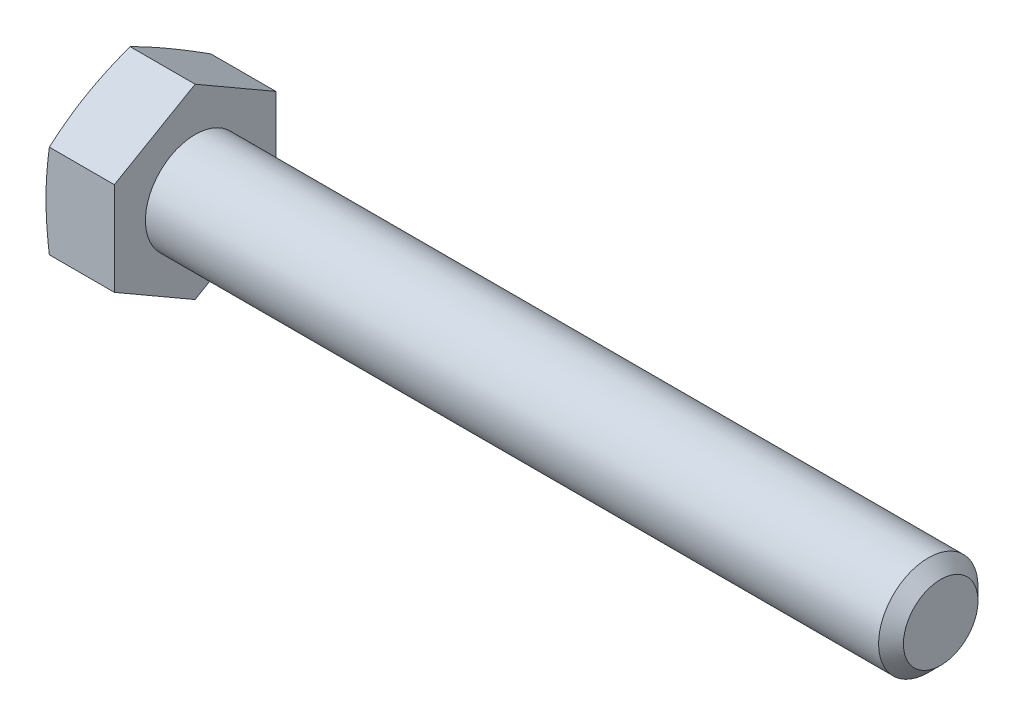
ISO-10303-21;
HEADER;
FILE_DESCRIPTION(('STEP AP214'),'2;1');
FILE_NAME('part.step','',(''),(''),'','','');
FILE_SCHEMA(('AUTOMOTIVE_DESIGN { 1 0 10303 214 1 1 1 1 }'));
ENDSEC;
DATA;
#1=APPLICATION_CONTEXT('core data for automotive mechanical design processes');
#2=APPLICATION_PROTOCOL_DEFINITION('international standard','automotive_design',2000,#1);
#3=PRODUCT_CONTEXT('',#1,'mechanical');
#4=PRODUCT('Part','Part','',(#3));
#5=PRODUCT_RELATED_PRODUCT_CATEGORY('part','',(#4));
#6=PRODUCT_DEFINITION_FORMATION('','',#4);
#7=PRODUCT_DEFINITION_CONTEXT('part definition',#1,'design');
#8=PRODUCT_DEFINITION('design','',#6,#7);
#9=PRODUCT_DEFINITION_SHAPE('','',#8);
#10=(LENGTH_UNIT() NAMED_UNIT(*) SI_UNIT(.MILLI.,.METRE.));
#11=(NAMED_UNIT(*) PLANE_ANGLE_UNIT() SI_UNIT($,.RADIAN.));
#12=(NAMED_UNIT(*) SI_UNIT($,.STERADIAN.) SOLID_ANGLE_UNIT());
#13=UNCERTAINTY_MEASURE_WITH_UNIT(LENGTH_MEASURE(1.E-05),#10,'distance_accuracy_value','');
#14=(GEOMETRIC_REPRESENTATION_CONTEXT(3) GLOBAL_UNCERTAINTY_ASSIGNED_CONTEXT((#13)) GLOBAL_UNIT_ASSIGNED_CONTEXT((#10,
#11,#12)) REPRESENTATION_CONTEXT('',''));
#15=CARTESIAN_POINT('',(0.,0.,0.));
#16=DIRECTION('',(0.,0.,1.));
#17=DIRECTION('',(1.,0.,0.));
#18=AXIS2_PLACEMENT_3D('',#15,#16,#17);
#19=CARTESIAN_POINT('',(114.087832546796,143.540633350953,0.));
#20=DIRECTION('',(1.,0.,0.));
#21=DIRECTION('',(0.,0.,-1.));
#22=AXIS2_PLACEMENT_3D('',#19,#20,#21);
#23=CONICAL_SURFACE('',#22,7.5115886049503,1.30899693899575);
#24=CARTESIAN_POINT('',(113.816778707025,137.912589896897,-3.25194582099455));
#25=CARTESIAN_POINT('',(113.816786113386,137.991044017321,-3.38783234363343));
#26=CARTESIAN_POINT('',(113.818330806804,138.069495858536,-3.52371491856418));
#27=CARTESIAN_POINT('',(113.824434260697,138.226367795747,-3.79542508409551));
#28=CARTESIAN_POINT('',(113.828992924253,138.304787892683,-3.93125267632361));
#29=CARTESIAN_POINT('',(113.847085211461,138.539784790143,-4.33827924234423));
#30=CARTESIAN_POINT('',(113.865035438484,138.696281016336,-4.60933865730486));
#31=CARTESIAN_POINT('',(113.911617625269,139.008823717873,-5.1506784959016));
#32=CARTESIAN_POINT('',(113.940247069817,139.164870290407,-5.42095908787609));
#33=CARTESIAN_POINT('',(114.006706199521,139.476656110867,-5.96098796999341));
#34=CARTESIAN_POINT('',(114.044546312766,139.632394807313,-6.2307353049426));
#35=CARTESIAN_POINT('',(114.086215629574,139.787854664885,-6.49999967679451));
#36=B_SPLINE_CURVE_WITH_KNOTS('',3,(#24,#25,#26,#27,#28,#29,#30,#31,#32,#33,#34,#35),
.UNSPECIFIED.,.F.,.F.,(4,2,2,2,2,4),(0.,0.470708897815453,0.941402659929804,1.88169399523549,
2.8217640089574,3.76290333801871),.UNSPECIFIED.);
#37=CARTESIAN_POINT('',(113.816778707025,137.912589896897,-3.25194582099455));
#38=VERTEX_POINT('',#37);
#39=CARTESIAN_POINT('',(114.086215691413,139.787854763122,-6.49999999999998));
#40=VERTEX_POINT('',#39);
#41=EDGE_CURVE('E294',#38,#40,#36,.T.);
#42=ORIENTED_EDGE('',*,*,#41,.F.);
#43=CARTESIAN_POINT('',(113.816778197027,143.540633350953,0.));
#44=DIRECTION('',(1.,0.,0.));
#45=DIRECTION('',(0.,0.,-1.));
#46=AXIS2_PLACEMENT_3D('',#43,#44,#45);
#47=CIRCLE('',#46,6.50000000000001);
#48=CARTESIAN_POINT('',(113.816778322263,143.538864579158,-6.49999998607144));
#49=VERTEX_POINT('',#48);
#50=EDGE_CURVE('E194',#38,#49,#47,.T.);
#51=ORIENTED_EDGE('',*,*,#50,.T.);
#52=CARTESIAN_POINT('',(114.086215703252,139.787854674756,-6.49999999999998));
#53=CARTESIAN_POINT('',(114.044541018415,140.098814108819,-6.49999999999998));
#54=CARTESIAN_POINT('',(114.00669652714,140.410331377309,-6.49999999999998));
#55=CARTESIAN_POINT('',(113.940231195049,141.033982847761,-6.49999999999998));
#56=CARTESIAN_POINT('',(113.911599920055,141.346115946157,-6.49999999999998));
#57=CARTESIAN_POINT('',(113.865017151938,141.97128144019,-6.49999999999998));
#58=CARTESIAN_POINT('',(113.847068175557,142.284314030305,-6.49999999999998));
#59=CARTESIAN_POINT('',(113.82898025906,142.754368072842,-6.49999999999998));
#60=CARTESIAN_POINT('',(113.824423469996,142.911228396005,-6.49999999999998));
#61=CARTESIAN_POINT('',(113.818324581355,143.225012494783,-6.49999999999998));
#62=CARTESIAN_POINT('',(113.816782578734,143.381936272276,-6.49999999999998));
#63=CARTESIAN_POINT('',(113.816778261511,143.538864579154,-6.49999999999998));
#64=B_SPLINE_CURVE_WITH_KNOTS('',3,(#52,#53,#54,#55,#56,#57,#58,#59,#60,#61,#62,#63),
.UNSPECIFIED.,.F.,.F.,(4,2,2,2,2,4),(0.,0.941259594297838,1.88144940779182,2.82186064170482,
3.29261459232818,3.76338368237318),.UNSPECIFIED.);
#65=EDGE_CURVE('E192',#40,#49,#64,.T.);
#66=ORIENTED_EDGE('',*,*,#65,.F.);
#67=EDGE_LOOP('',(#42,#51,#66));
#68=FACE_BOUND('',#67,.T.);
#69=ADVANCED_FACE('F16',(#68),#23,.T.);
#70=CARTESIAN_POINT('',(114.087832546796,143.540633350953,0.));
#71=DIRECTION('',(1.,0.,0.));
#72=DIRECTION('',(0.,0.,-1.));
#73=AXIS2_PLACEMENT_3D('',#70,#71,#72);
#74=CONICAL_SURFACE('',#73,7.5115886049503,1.30899693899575);
#75=CARTESIAN_POINT('',(113.816778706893,137.91034464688,3.24805693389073));
#76=CARTESIAN_POINT('',(113.816786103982,137.831890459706,3.11217029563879));
#77=CARTESIAN_POINT('',(113.818330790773,137.753438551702,2.97628760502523));
#78=CARTESIAN_POINT('',(113.824434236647,137.596566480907,2.70457720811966));
#79=CARTESIAN_POINT('',(113.82899289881,137.518146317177,2.56874950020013));
#80=CARTESIAN_POINT('',(113.847085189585,137.283149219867,2.16172258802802));
#81=CARTESIAN_POINT('',(113.865035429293,137.126652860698,1.89066294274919));
#82=CARTESIAN_POINT('',(113.911617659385,136.814109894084,1.34932264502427));
#83=CARTESIAN_POINT('',(113.940247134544,136.658063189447,1.07904182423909));
#84=CARTESIAN_POINT('',(114.006706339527,136.346277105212,0.539012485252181));
#85=CARTESIAN_POINT('',(114.044546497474,136.190538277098,0.269264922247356));
#86=CARTESIAN_POINT('',(114.086215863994,136.035078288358,3.23205537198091E-07));
#87=B_SPLINE_CURVE_WITH_KNOTS('',3,(#75,#76,#77,#78,#79,#80,#81,#82,#83,#84,#85,#86),
.UNSPECIFIED.,.F.,.F.,(4,2,2,2,2,4),(0.,0.470709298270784,0.941403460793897,1.88169559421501,
2.82176640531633,3.76290653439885),.UNSPECIFIED.);
#88=CARTESIAN_POINT('',(113.816778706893,137.91034464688,3.24805693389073));
#89=VERTEX_POINT('',#88);
#90=CARTESIAN_POINT('',(114.086215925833,136.035078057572,7.65271664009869E-08));
#91=VERTEX_POINT('',#90);
#92=EDGE_CURVE('E216',#89,#91,#87,.T.);
#93=ORIENTED_EDGE('',*,*,#92,.F.);
#94=CARTESIAN_POINT('',(113.816778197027,143.540633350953,0.));
#95=DIRECTION('',(1.,0.,0.));
#96=DIRECTION('',(0.,0.,-1.));
#97=AXIS2_PLACEMENT_3D('',#94,#95,#96);
#98=CIRCLE('',#97,6.50000000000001);
#99=EDGE_CURVE('E20',#89,#38,#98,.T.);
#100=ORIENTED_EDGE('',*,*,#99,.T.);
#101=CARTESIAN_POINT('',(114.086215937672,136.035078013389,1.53054314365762E-07));
#102=CARTESIAN_POINT('',(114.044496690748,136.190723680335,-0.269586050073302));
#103=CARTESIAN_POINT('',(114.00661593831,136.346648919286,-0.539656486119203));
#104=CARTESIAN_POINT('',(113.940099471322,136.658808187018,-1.08033219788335));
#105=CARTESIAN_POINT('',(113.911453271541,136.815041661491,-1.35093651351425));
#106=CARTESIAN_POINT('',(113.864866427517,137.12795902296,-1.89292528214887));
#107=CARTESIAN_POINT('',(113.846928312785,137.2846430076,-2.16430990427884));
#108=CARTESIAN_POINT('',(113.828877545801,137.519921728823,-2.57182460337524));
#109=CARTESIAN_POINT('',(113.824336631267,137.598435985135,-2.70781528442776));
#110=CARTESIAN_POINT('',(113.818276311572,137.755496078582,-2.97985134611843));
#111=CARTESIAN_POINT('',(113.816757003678,137.834041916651,-3.11589672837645));
#112=CARTESIAN_POINT('',(113.816778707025,137.912589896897,-3.25194582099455));
#113=B_SPLINE_CURVE_WITH_KNOTS('',3,(#101,#102,#103,#104,#105,#106,#107,#108,#109,#110,#111,
#112),.UNSPECIFIED.,.F.,.F.,(4,2,2,2,2,4),(0.,0.942264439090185,1.88345519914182,
2.82486820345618,3.29612504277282,3.76739705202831),.UNSPECIFIED.);
#114=EDGE_CURVE('E302',#91,#38,#113,.T.);
#115=ORIENTED_EDGE('',*,*,#114,.F.);
#116=EDGE_LOOP('',(#93,#100,#115));
#117=FACE_BOUND('',#116,.T.);
#118=ADVANCED_FACE('F309',(#117),#74,.T.);
#119=CARTESIAN_POINT('',(113.816778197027,146.790633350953,0.));
#120=DIRECTION('',(-1.,0.,0.));
#121=DIRECTION('',(0.,0.,1.));
#122=AXIS2_PLACEMENT_3D('',#119,#120,#121);
#123=PLANE('',#122);
#124=DIRECTION('',(0.,0.500000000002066,-0.866025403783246));
#125=VECTOR('',#124,1.);
#126=CARTESIAN_POINT('',(113.816778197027,149.16757798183,3.25384297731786));
#127=LINE('',#126,#125);
#128=CARTESIAN_POINT('',(113.816778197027,149.167577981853,3.25384297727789));
#129=VERTEX_POINT('',#128);
#130=CARTESIAN_POINT('',(113.816778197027,149.172016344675,3.24615550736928));
#131=VERTEX_POINT('',#130);
#132=EDGE_CURVE('E90',#129,#131,#127,.T.);
#133=ORIENTED_EDGE('',*,*,#132,.T.);
#134=CARTESIAN_POINT('',(113.816778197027,143.540633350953,0.));
#135=DIRECTION('',(1.,0.,0.));
#136=DIRECTION('',(0.,0.,-1.));
#137=AXIS2_PLACEMENT_3D('',#134,#135,#136);
#138=CIRCLE('',#137,6.50000000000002);
#139=CARTESIAN_POINT('',(113.816778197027,149.172016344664,-3.24615550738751));
#140=VERTEX_POINT('',#139);
#141=EDGE_CURVE('E93',#140,#131,#138,.T.);
#142=ORIENTED_EDGE('',*,*,#141,.F.);
#143=DIRECTION('',(0.,-0.499999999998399,-0.866025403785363));
#144=VECTOR('',#143,1.);
#145=CARTESIAN_POINT('',(113.816778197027,149.172016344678,-3.24615550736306));
#146=LINE('',#145,#144);
#147=CARTESIAN_POINT('',(113.816778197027,149.167577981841,-3.25384297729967));
#148=VERTEX_POINT('',#147);
#149=EDGE_CURVE('E108',#140,#148,#146,.T.);
#150=ORIENTED_EDGE('',*,*,#149,.T.);
#151=CARTESIAN_POINT('',(113.816778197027,143.540633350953,0.));
#152=DIRECTION('',(1.,0.,0.));
#153=DIRECTION('',(0.,0.,-1.));
#154=AXIS2_PLACEMENT_3D('',#151,#152,#153);
#155=CIRCLE('',#154,6.49999999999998);
#156=EDGE_CURVE('E201',#49,#148,#155,.T.);
#157=ORIENTED_EDGE('',*,*,#156,.F.);
#158=ORIENTED_EDGE('',*,*,#50,.F.);
#159=ORIENTED_EDGE('',*,*,#99,.F.);
#160=CARTESIAN_POINT('',(113.816778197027,143.540633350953,0.));
#161=DIRECTION('',(1.,0.,0.));
#162=DIRECTION('',(0.,0.,-1.));
#163=AXIS2_PLACEMENT_3D('',#160,#161,#162);
#164=CIRCLE('',#163,6.50000000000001);
#165=CARTESIAN_POINT('',(113.816778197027,143.540633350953,6.50000000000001));
#166=VERTEX_POINT('',#165);
#167=EDGE_CURVE('E10',#166,#89,#164,.T.);
#168=ORIENTED_EDGE('',*,*,#167,.F.);
#169=CARTESIAN_POINT('',(113.816778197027,143.540633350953,0.));
#170=DIRECTION('',(1.,0.,0.));
#171=DIRECTION('',(0.,0.,-1.));
#172=AXIS2_PLACEMENT_3D('',#169,#170,#171);
#173=CIRCLE('',#172,6.49999999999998);
#174=EDGE_CURVE('E96',#129,#166,#173,.T.);
#175=ORIENTED_EDGE('',*,*,#174,.F.);
#176=EDGE_LOOP('',(#133,#142,#150,#157,#158,#159,#168,#175));
#177=FACE_BOUND('',#176,.T.);
#178=ADVANCED_FACE('F92',(#177),#123,.T.);
#179=CARTESIAN_POINT('',(113.816778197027,147.293408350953,6.50000000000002));
#180=DIRECTION('',(0.,0.866025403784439,0.499999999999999));
#181=DIRECTION('',(0.,-0.499999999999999,0.866025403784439));
#182=AXIS2_PLACEMENT_3D('',#179,#180,#181);
#183=PLANE('',#182);
#184=CARTESIAN_POINT('',(113.816778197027,149.167577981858,3.2538429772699));
#185=CARTESIAN_POINT('',(113.816799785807,149.089169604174,3.38965027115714));
#186=CARTESIAN_POINT('',(113.818356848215,149.010763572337,3.52545350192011));
#187=CARTESIAN_POINT('',(113.824481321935,148.853983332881,3.7970048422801));
#188=CARTESIAN_POINT('',(113.829048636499,148.775609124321,3.93275295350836));
#189=CARTESIAN_POINT('',(113.847161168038,148.540749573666,4.33954162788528));
#190=CARTESIAN_POINT('',(113.865117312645,148.384344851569,4.61044255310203));
#191=CARTESIAN_POINT('',(113.91169727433,148.07198474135,5.15146613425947));
#192=CARTESIAN_POINT('',(113.940318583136,147.916029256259,5.42158895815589));
#193=CARTESIAN_POINT('',(114.006749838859,147.604425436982,5.96130260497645));
#194=CARTESIAN_POINT('',(114.044570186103,147.448777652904,6.23089247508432));
#195=CARTESIAN_POINT('',(114.086215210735,147.293408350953,6.50000000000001));
#196=B_SPLINE_CURVE_WITH_KNOTS('',3,(#184,#185,#186,#187,#188,#189,#190,#191,#192,#193,#194,
#195),.UNSPECIFIED.,.F.,.F.,(4,2,2,2,2,4),(0.,0.470434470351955,0.940853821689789,
1.88059851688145,2.82012233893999,3.76071335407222),.UNSPECIFIED.);
#197=CARTESIAN_POINT('',(114.086215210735,147.293408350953,6.50000000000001));
#198=VERTEX_POINT('',#197);
#199=EDGE_CURVE('E199',#129,#198,#196,.T.);
#200=ORIENTED_EDGE('',*,*,#199,.T.);
#201=DIRECTION('',(1.,0.,0.));
#202=VECTOR('',#201,1.);
#203=CARTESIAN_POINT('',(113.816778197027,147.293408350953,6.50000000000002));
#204=LINE('',#203,#202);
#205=CARTESIAN_POINT('',(119.316778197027,147.293408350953,6.50000000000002));
#206=VERTEX_POINT('',#205);
#207=EDGE_CURVE('E421',#206,#198,#204,.F.);
#208=ORIENTED_EDGE('',*,*,#207,.F.);
#209=DIRECTION('',(0.,-0.499999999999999,0.866025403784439));
#210=VECTOR('',#209,1.);
#211=CARTESIAN_POINT('',(119.316778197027,151.046185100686,0.));
#212=LINE('',#211,#210);
#213=CARTESIAN_POINT('',(119.316778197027,151.046185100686,0.));
#214=VERTEX_POINT('',#213);
#215=EDGE_CURVE('E117',#214,#206,#212,.T.);
#216=ORIENTED_EDGE('',*,*,#215,.F.);
#217=DIRECTION('',(1.,0.,0.));
#218=VECTOR('',#217,1.);
#219=CARTESIAN_POINT('',(113.816778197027,151.046185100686,0.));
#220=LINE('',#219,#218);
#221=CARTESIAN_POINT('',(114.086214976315,151.046185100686,0.));
#222=VERTEX_POINT('',#221);
#223=EDGE_CURVE('E112',#214,#222,#220,.F.);
#224=ORIENTED_EDGE('',*,*,#223,.T.);
#225=CARTESIAN_POINT('',(114.086214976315,151.046185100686,0.));
#226=CARTESIAN_POINT('',(114.044569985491,150.890815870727,0.269107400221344));
#227=CARTESIAN_POINT('',(114.006749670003,150.735168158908,0.538697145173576));
#228=CARTESIAN_POINT('',(113.940318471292,150.42356448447,1.07841054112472));
#229=CARTESIAN_POINT('',(113.911697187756,150.267609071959,1.34853323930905));
#230=CARTESIAN_POINT('',(113.865117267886,149.955249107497,1.8895565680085));
#231=CARTESIAN_POINT('',(113.847161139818,149.798844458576,2.16045736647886));
#232=CARTESIAN_POINT('',(113.829048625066,149.563985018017,2.56724585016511));
#233=CARTESIAN_POINT('',(113.824481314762,149.485610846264,2.70299389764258));
#234=CARTESIAN_POINT('',(113.818356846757,149.328830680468,2.97454511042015));
#235=CARTESIAN_POINT('',(113.816799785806,149.250424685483,3.11034827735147));
#236=CARTESIAN_POINT('',(113.816778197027,149.172016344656,3.24615550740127));
#237=B_SPLINE_CURVE_WITH_KNOTS('',3,(#225,#226,#227,#228,#229,#230,#231,#232,#233,#234,#235,
#236),.UNSPECIFIED.,.F.,.F.,(4,2,2,2,2,4),(0.,0.940590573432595,1.88011395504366,
2.81985820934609,3.29027733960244,3.76071158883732),.UNSPECIFIED.);
#238=EDGE_CURVE('E105',#222,#131,#237,.T.);
#239=ORIENTED_EDGE('',*,*,#238,.T.);
#240=ORIENTED_EDGE('',*,*,#132,.F.);
#241=EDGE_LOOP('',(#200,#208,#216,#224,#239,#240));
#242=FACE_BOUND('',#241,.T.);
#243=ADVANCED_FACE('F110',(#242),#183,.T.);
#244=CARTESIAN_POINT('',(113.816778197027,147.293408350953,-6.49999999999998));
#245=DIRECTION('',(0.,0.,-1.));
#246=DIRECTION('',(0.,1.,0.));
#247=AXIS2_PLACEMENT_3D('',#244,#245,#246);
#248=PLANE('',#247);
#249=CARTESIAN_POINT('',(113.816778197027,143.540633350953,-6.49999999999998));
#250=CARTESIAN_POINT('',(113.816771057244,143.697635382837,-6.49999999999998));
#251=CARTESIAN_POINT('',(113.818303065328,143.85463299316,-6.49999999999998));
#252=CARTESIAN_POINT('',(113.824384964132,144.168564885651,-6.49999999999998));
#253=CARTESIAN_POINT('',(113.828934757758,144.325499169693,-6.49999999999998));
#254=CARTESIAN_POINT('',(113.847006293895,144.795774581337,-6.49999999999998));
#255=CARTESIAN_POINT('',(113.864950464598,145.108954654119,-6.49999999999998));
#256=CARTESIAN_POINT('',(113.91153496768,145.734414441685,-6.49999999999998));
#257=CARTESIAN_POINT('',(113.940172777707,146.046694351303,-6.49999999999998));
#258=CARTESIAN_POINT('',(114.006660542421,146.670639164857,-6.49999999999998));
#259=CARTESIAN_POINT('',(114.044520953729,146.982302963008,-6.49999999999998));
#260=CARTESIAN_POINT('',(114.086215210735,147.293408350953,-6.49999999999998));
#261=B_SPLINE_CURVE_WITH_KNOTS('',3,(#249,#250,#251,#252,#253,#254,#255,#256,#257,#258,#259,
#260),.UNSPECIFIED.,.F.,.F.,(4,2,2,2,2,4),(0.,0.470990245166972,0.941965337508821,
1.88281709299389,2.82344706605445,3.76514853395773),.UNSPECIFIED.);
#262=CARTESIAN_POINT('',(114.086215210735,147.293408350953,-6.49999999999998));
#263=VERTEX_POINT('',#262);
#264=EDGE_CURVE('E113',#49,#263,#261,.T.);
#265=ORIENTED_EDGE('',*,*,#264,.T.);
#266=DIRECTION('',(1.,0.,0.));
#267=VECTOR('',#266,1.);
#268=CARTESIAN_POINT('',(113.816778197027,147.293408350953,-6.49999999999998));
#269=LINE('',#268,#267);
#270=CARTESIAN_POINT('',(119.316778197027,147.293408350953,-6.49999999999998));
#271=VERTEX_POINT('',#270);
#272=EDGE_CURVE('E115',#263,#271,#269,.T.);
#273=ORIENTED_EDGE('',*,*,#272,.T.);
#274=DIRECTION('',(0.,1.,0.));
#275=VECTOR('',#274,1.);
#276=CARTESIAN_POINT('',(119.316778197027,158.040633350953,-6.49999999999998));
#277=LINE('',#276,#275);
#278=CARTESIAN_POINT('',(119.316778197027,139.787854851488,-6.49999999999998));
#279=VERTEX_POINT('',#278);
#280=EDGE_CURVE('E212',#279,#271,#277,.T.);
#281=ORIENTED_EDGE('',*,*,#280,.F.);
#282=DIRECTION('',(1.,0.,0.));
#283=VECTOR('',#282,1.);
#284=CARTESIAN_POINT('',(113.816778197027,139.787854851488,-6.49999999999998));
#285=LINE('',#284,#283);
#286=EDGE_CURVE('E208',#279,#40,#285,.F.);
#287=ORIENTED_EDGE('',*,*,#286,.T.);
#288=ORIENTED_EDGE('',*,*,#65,.T.);
#289=EDGE_LOOP('',(#265,#273,#281,#287,#288));
#290=FACE_BOUND('',#289,.T.);
#291=ADVANCED_FACE('F177',(#290),#248,.T.);
#292=CARTESIAN_POINT('',(113.816778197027,139.787854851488,-6.49999999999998));
#293=DIRECTION('',(0.,-0.866025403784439,-0.499999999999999));
#294=DIRECTION('',(0.,0.499999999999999,-0.866025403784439));
#295=AXIS2_PLACEMENT_3D('',#292,#293,#294);
#296=PLANE('',#295);
#297=ORIENTED_EDGE('',*,*,#41,.T.);
#298=ORIENTED_EDGE('',*,*,#286,.F.);
#299=DIRECTION('',(0.,0.499999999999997,-0.86602540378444));
#300=VECTOR('',#299,1.);
#301=CARTESIAN_POINT('',(119.316778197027,136.035078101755,0.));
#302=LINE('',#301,#300);
#303=CARTESIAN_POINT('',(119.316778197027,136.035078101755,0.));
#304=VERTEX_POINT('',#303);
#305=EDGE_CURVE('E217',#304,#279,#302,.T.);
#306=ORIENTED_EDGE('',*,*,#305,.F.);
#307=DIRECTION('',(1.,0.,0.));
#308=VECTOR('',#307,1.);
#309=CARTESIAN_POINT('',(113.816778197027,136.035078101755,0.));
#310=LINE('',#309,#308);
#311=EDGE_CURVE('E213',#304,#91,#310,.F.);
#312=ORIENTED_EDGE('',*,*,#311,.T.);
#313=ORIENTED_EDGE('',*,*,#114,.T.);
#314=EDGE_LOOP('',(#297,#298,#306,#312,#313));
#315=FACE_BOUND('',#314,.T.);
#316=ADVANCED_FACE('F181',(#315),#296,.T.);
#317=CARTESIAN_POINT('',(113.816778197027,136.035078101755,0.));
#318=DIRECTION('',(0.,-0.866025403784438,0.500000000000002));
#319=DIRECTION('',(0.,-0.500000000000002,-0.866025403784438));
#320=AXIS2_PLACEMENT_3D('',#317,#318,#319);
#321=PLANE('',#320);
#322=ORIENTED_EDGE('',*,*,#92,.T.);
#323=ORIENTED_EDGE('',*,*,#311,.F.);
#324=DIRECTION('',(0.,-0.5,-0.866025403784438));
#325=VECTOR('',#324,1.);
#326=CARTESIAN_POINT('',(119.316778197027,139.787854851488,6.50000000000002));
#327=LINE('',#326,#325);
#328=CARTESIAN_POINT('',(119.316778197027,139.787854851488,6.50000000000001));
#329=VERTEX_POINT('',#328);
#330=EDGE_CURVE('E221',#329,#304,#327,.T.);
#331=ORIENTED_EDGE('',*,*,#330,.F.);
#332=DIRECTION('',(1.,0.,0.));
#333=VECTOR('',#332,1.);
#334=CARTESIAN_POINT('',(113.816778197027,139.787854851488,6.50000000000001));
#335=LINE('',#334,#333);
#336=CARTESIAN_POINT('',(114.086215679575,139.787854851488,6.50000000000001));
#337=VERTEX_POINT('',#336);
#338=EDGE_CURVE('E218',#329,#337,#335,.F.);
#339=ORIENTED_EDGE('',*,*,#338,.T.);
#340=CARTESIAN_POINT('',(114.086215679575,139.787854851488,6.50000000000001));
#341=CARTESIAN_POINT('',(114.044496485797,139.632209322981,6.23041403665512));
#342=CARTESIAN_POINT('',(114.006615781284,139.476284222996,5.96034384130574));
#343=CARTESIAN_POINT('',(113.940099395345,139.164125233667,5.41966861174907));
#344=CARTESIAN_POINT('',(113.911453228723,139.007891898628,5.14906453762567));
#345=CARTESIAN_POINT('',(113.864866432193,138.694974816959,4.60707625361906));
#346=CARTESIAN_POINT('',(113.846928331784,138.538290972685,4.33569187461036));
#347=CARTESIAN_POINT('',(113.82887756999,138.303012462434,3.9281775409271));
#348=CARTESIAN_POINT('',(113.824336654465,138.224498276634,3.79218698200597));
#349=CARTESIAN_POINT('',(113.818276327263,138.067438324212,3.52015116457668));
#350=CARTESIAN_POINT('',(113.816757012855,137.988892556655,3.38410590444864));
#351=CARTESIAN_POINT('',(113.816778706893,137.91034464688,3.24805693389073));
#352=B_SPLINE_CURVE_WITH_KNOTS('',3,(#340,#341,#342,#343,#344,#345,#346,#347,#348,#349,#350,
#351),.UNSPECIFIED.,.F.,.F.,(4,2,2,2,2,4),(0.,0.942263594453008,1.88345351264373,
2.8248656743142,3.29612209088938,3.76739367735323),.UNSPECIFIED.);
#353=EDGE_CURVE('E229',#337,#89,#352,.T.);
#354=ORIENTED_EDGE('',*,*,#353,.T.);
#355=EDGE_LOOP('',(#322,#323,#331,#339,#354));
#356=FACE_BOUND('',#355,.T.);
#357=ADVANCED_FACE('F278',(#356),#321,.T.);
#358=CARTESIAN_POINT('',(113.816778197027,139.787854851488,6.50000000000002));
#359=DIRECTION('',(0.,0.,1.));
#360=DIRECTION('',(0.,-1.,0.));
#361=AXIS2_PLACEMENT_3D('',#358,#359,#360);
#362=PLANE('',#361);
#363=CARTESIAN_POINT('',(113.816778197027,143.540633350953,6.50000000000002));
#364=CARTESIAN_POINT('',(113.816771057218,143.383631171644,6.50000000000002));
#365=CARTESIAN_POINT('',(113.818303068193,143.226633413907,6.50000000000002));
#366=CARTESIAN_POINT('',(113.82438497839,142.912701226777,6.50000000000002));
#367=CARTESIAN_POINT('',(113.828934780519,142.755766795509,6.50000000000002));
#368=CARTESIAN_POINT('',(113.847006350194,142.285490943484,6.50000000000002));
#369=CARTESIAN_POINT('',(113.864950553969,141.972310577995,6.50000000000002));
#370=CARTESIAN_POINT('',(113.911535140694,141.346850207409,6.50000000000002));
#371=CARTESIAN_POINT('',(113.94017300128,141.034570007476,6.50000000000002));
#372=CARTESIAN_POINT('',(114.006660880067,140.410624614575,6.50000000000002));
#373=CARTESIAN_POINT('',(114.044521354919,140.098960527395,6.50000000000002));
#374=CARTESIAN_POINT('',(114.086215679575,139.787854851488,6.50000000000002));
#375=B_SPLINE_CURVE_WITH_KNOTS('',3,(#363,#364,#365,#366,#367,#368,#369,#370,#371,#372,#373,
#374),.UNSPECIFIED.,.F.,.F.,(4,2,2,2,2,4),(0.,0.470990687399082,0.941966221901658,
1.88281885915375,2.82344971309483,3.76515206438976),.UNSPECIFIED.);
#376=EDGE_CURVE('E25',#166,#337,#375,.T.);
#377=ORIENTED_EDGE('',*,*,#376,.T.);
#378=ORIENTED_EDGE('',*,*,#338,.F.);
#379=DIRECTION('',(0.,1.,0.));
#380=VECTOR('',#379,1.);
#381=CARTESIAN_POINT('',(119.316778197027,158.040633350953,6.50000000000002));
#382=LINE('',#381,#380);
#383=EDGE_CURVE('E149',#206,#329,#382,.F.);
#384=ORIENTED_EDGE('',*,*,#383,.F.);
#385=ORIENTED_EDGE('',*,*,#207,.T.);
#386=CARTESIAN_POINT('',(114.086215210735,147.293408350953,6.50000000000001));
#387=CARTESIAN_POINT('',(114.044520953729,146.982302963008,6.50000000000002));
#388=CARTESIAN_POINT('',(114.006660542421,146.670639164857,6.50000000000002));
#389=CARTESIAN_POINT('',(113.940172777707,146.046694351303,6.50000000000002));
#390=CARTESIAN_POINT('',(113.91153496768,145.734414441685,6.50000000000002));
#391=CARTESIAN_POINT('',(113.864950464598,145.108954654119,6.50000000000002));
#392=CARTESIAN_POINT('',(113.847006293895,144.795774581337,6.50000000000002));
#393=CARTESIAN_POINT('',(113.828934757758,144.325499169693,6.50000000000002));
#394=CARTESIAN_POINT('',(113.824384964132,144.168564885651,6.50000000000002));
#395=CARTESIAN_POINT('',(113.818303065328,143.85463299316,6.50000000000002));
#396=CARTESIAN_POINT('',(113.816771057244,143.697635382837,6.50000000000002));
#397=CARTESIAN_POINT('',(113.816778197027,143.540633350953,6.50000000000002));
#398=B_SPLINE_CURVE_WITH_KNOTS('',3,(#386,#387,#388,#389,#390,#391,#392,#393,#394,#395,#396,
#397),.UNSPECIFIED.,.F.,.F.,(4,2,2,2,2,4),(0.,0.941701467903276,1.88233144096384,
2.82318319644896,3.29415828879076,3.76514853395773),.UNSPECIFIED.);
#399=EDGE_CURVE('E148',#198,#166,#398,.T.);
#400=ORIENTED_EDGE('',*,*,#399,.T.);
#401=EDGE_LOOP('',(#377,#378,#384,#385,#400));
#402=FACE_BOUND('',#401,.T.);
#403=ADVANCED_FACE('F135',(#402),#362,.T.);
#404=CARTESIAN_POINT('',(114.087831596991,143.540633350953,0.));
#405=DIRECTION('',(1.,0.,0.));
#406=DIRECTION('',(0.,0.,-1.));
#407=AXIS2_PLACEMENT_3D('',#404,#405,#406);
#408=CONICAL_SURFACE('',#407,7.51158506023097,1.30899693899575);
#409=ORIENTED_EDGE('',*,*,#141,.T.);
#410=ORIENTED_EDGE('',*,*,#238,.F.);
#411=CARTESIAN_POINT('',(113.816778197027,149.172016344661,-3.24615550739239));
#412=CARTESIAN_POINT('',(113.816799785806,149.250424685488,-3.11034827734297));
#413=CARTESIAN_POINT('',(113.818356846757,149.328830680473,-2.97454511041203));
#414=CARTESIAN_POINT('',(113.824481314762,149.485610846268,-2.70299389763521));
#415=CARTESIAN_POINT('',(113.829048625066,149.563985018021,-2.5672458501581));
#416=CARTESIAN_POINT('',(113.847161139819,149.79884445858,-2.16045736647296));
#417=CARTESIAN_POINT('',(113.865117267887,149.9552491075,-1.88955656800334));
#418=CARTESIAN_POINT('',(113.911697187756,150.267609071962,-1.34853323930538));
#419=CARTESIAN_POINT('',(113.940318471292,150.423564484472,-1.07841054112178));
#420=CARTESIAN_POINT('',(114.006749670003,150.735168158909,-0.538697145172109));
#421=CARTESIAN_POINT('',(114.044569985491,150.890815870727,-0.269107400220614));
#422=CARTESIAN_POINT('',(114.086214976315,151.046185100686,0.));
#423=B_SPLINE_CURVE_WITH_KNOTS('',3,(#411,#412,#413,#414,#415,#416,#417,#418,#419,#420,#421,
#422),.UNSPECIFIED.,.F.,.F.,(4,2,2,2,2,4),(0.,0.47043424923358,0.940853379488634,
1.88059763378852,2.82012101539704,3.76071158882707),.UNSPECIFIED.);
#424=EDGE_CURVE('E107',#140,#222,#423,.T.);
#425=ORIENTED_EDGE('',*,*,#424,.F.);
#426=EDGE_LOOP('',(#409,#410,#425));
#427=FACE_BOUND('',#426,.T.);
#428=ADVANCED_FACE('F104',(#427),#408,.T.);
#429=CARTESIAN_POINT('',(113.816778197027,151.046185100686,0.));
#430=DIRECTION('',(0.,0.866025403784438,-0.500000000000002));
#431=DIRECTION('',(0.,0.500000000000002,0.866025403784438));
#432=AXIS2_PLACEMENT_3D('',#429,#430,#431);
#433=PLANE('',#432);
#434=ORIENTED_EDGE('',*,*,#424,.T.);
#435=ORIENTED_EDGE('',*,*,#223,.F.);
#436=DIRECTION('',(0.,0.500000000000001,0.866025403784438));
#437=VECTOR('',#436,1.);
#438=CARTESIAN_POINT('',(119.316778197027,147.293408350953,-6.49999999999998));
#439=LINE('',#438,#437);
#440=EDGE_CURVE('E147',#271,#214,#439,.T.);
#441=ORIENTED_EDGE('',*,*,#440,.F.);
#442=ORIENTED_EDGE('',*,*,#272,.F.);
#443=CARTESIAN_POINT('',(114.086215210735,147.293408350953,-6.49999999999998));
#444=CARTESIAN_POINT('',(114.044570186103,147.448777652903,-6.23089247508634));
#445=CARTESIAN_POINT('',(114.00674983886,147.604425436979,-5.96130260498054));
#446=CARTESIAN_POINT('',(113.940318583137,147.916029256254,-5.42158895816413));
#447=CARTESIAN_POINT('',(113.911697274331,148.071984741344,-5.15146613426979));
#448=CARTESIAN_POINT('',(113.865117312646,148.38434485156,-4.61044255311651));
#449=CARTESIAN_POINT('',(113.847161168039,148.540749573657,-4.33954162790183));
#450=CARTESIAN_POINT('',(113.829048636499,148.77560912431,-3.93275295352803));
#451=CARTESIAN_POINT('',(113.824481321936,148.853983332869,-3.79700484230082));
#452=CARTESIAN_POINT('',(113.818356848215,149.010763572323,-3.52545350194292));
#453=CARTESIAN_POINT('',(113.816799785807,149.089169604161,-3.38965027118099));
#454=CARTESIAN_POINT('',(113.816778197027,149.167577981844,-3.25384297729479));
#455=B_SPLINE_CURVE_WITH_KNOTS('',3,(#443,#444,#445,#446,#447,#448,#449,#450,#451,#452,#453,
#454),.UNSPECIFIED.,.F.,.F.,(4,2,2,2,2,4),(0.,0.940591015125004,1.88011483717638,
2.81985953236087,3.29027888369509,3.76071335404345),.UNSPECIFIED.);
#456=EDGE_CURVE('E153',#263,#148,#455,.T.);
#457=ORIENTED_EDGE('',*,*,#456,.T.);
#458=ORIENTED_EDGE('',*,*,#149,.F.);
#459=EDGE_LOOP('',(#434,#435,#441,#442,#457,#458));
#460=FACE_BOUND('',#459,.T.);
#461=ADVANCED_FACE('F134',(#460),#433,.T.);
#462=CARTESIAN_POINT('',(114.087831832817,143.540633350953,0.));
#463=DIRECTION('',(1.,0.,0.));
#464=DIRECTION('',(0.,0.,-1.));
#465=AXIS2_PLACEMENT_3D('',#462,#463,#464);
#466=CONICAL_SURFACE('',#465,7.51158594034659,1.30899693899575);
#467=ORIENTED_EDGE('',*,*,#264,.F.);
#468=ORIENTED_EDGE('',*,*,#156,.T.);
#469=ORIENTED_EDGE('',*,*,#456,.F.);
#470=EDGE_LOOP('',(#467,#468,#469));
#471=FACE_BOUND('',#470,.T.);
#472=ADVANCED_FACE('F161',(#471),#466,.T.);
#473=CARTESIAN_POINT('',(114.087831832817,143.540633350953,0.));
#474=DIRECTION('',(1.,0.,0.));
#475=DIRECTION('',(0.,0.,-1.));
#476=AXIS2_PLACEMENT_3D('',#473,#474,#475);
#477=CONICAL_SURFACE('',#476,7.51158594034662,1.30899693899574);
#478=ORIENTED_EDGE('',*,*,#199,.F.);
#479=ORIENTED_EDGE('',*,*,#174,.T.);
#480=ORIENTED_EDGE('',*,*,#399,.F.);
#481=EDGE_LOOP('',(#478,#479,#480));
#482=FACE_BOUND('',#481,.T.);
#483=ADVANCED_FACE('F165',(#482),#477,.T.);
#484=CARTESIAN_POINT('',(119.316778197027,158.040633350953,0.));
#485=DIRECTION('',(1.,0.,0.));
#486=DIRECTION('',(0.,0.,-1.));
#487=AXIS2_PLACEMENT_3D('',#484,#485,#486);
#488=PLANE('',#487);
#489=ORIENTED_EDGE('',*,*,#305,.T.);
#490=ORIENTED_EDGE('',*,*,#280,.T.);
#491=ORIENTED_EDGE('',*,*,#440,.T.);
#492=ORIENTED_EDGE('',*,*,#215,.T.);
#493=ORIENTED_EDGE('',*,*,#383,.T.);
#494=ORIENTED_EDGE('',*,*,#330,.T.);
#495=EDGE_LOOP('',(#489,#490,#491,#492,#493,#494));
#496=FACE_BOUND('',#495,.T.);
#497=CARTESIAN_POINT('',(119.316778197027,143.540633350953,0.));
#498=DIRECTION('',(1.,0.,0.));
#499=DIRECTION('',(0.,0.,-1.));
#500=AXIS2_PLACEMENT_3D('',#497,#498,#499);
#501=CIRCLE('',#500,4.00000000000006);
#502=CARTESIAN_POINT('',(119.316778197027,143.540633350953,-4.00000000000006));
#503=VERTEX_POINT('',#502);
#504=EDGE_CURVE('E159',#503,#503,#501,.T.);
#505=ORIENTED_EDGE('',*,*,#504,.F.);
#506=EDGE_LOOP('',(#505));
#507=FACE_BOUND('',#506,.T.);
#508=ADVANCED_FACE('F239',(#496,#507),#488,.T.);
#509=CARTESIAN_POINT('',(179.316778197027,145.540633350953,0.));
#510=DIRECTION('',(1.,0.,0.));
#511=DIRECTION('',(0.,0.,-1.));
#512=AXIS2_PLACEMENT_3D('',#509,#510,#511);
#513=PLANE('',#512);
#514=CARTESIAN_POINT('',(179.316778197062,143.540633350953,0.));
#515=DIRECTION('',(-1.,0.,0.));
#516=DIRECTION('',(0.,0.,1.));
#517=AXIS2_PLACEMENT_3D('',#514,#515,#516);
#518=CIRCLE('',#517,2.99999999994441);
#519=CARTESIAN_POINT('',(179.316778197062,143.540633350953,2.99999999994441));
#520=VERTEX_POINT('',#519);
#521=EDGE_CURVE('E230',#520,#520,#518,.T.);
#522=ORIENTED_EDGE('',*,*,#521,.F.);
#523=EDGE_LOOP('',(#522));
#524=FACE_BOUND('',#523,.T.);
#525=ADVANCED_FACE('F241',(#524),#513,.T.);
#526=CARTESIAN_POINT('',(178.316778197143,143.540633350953,0.));
#527=DIRECTION('',(-1.,0.,0.));
#528=DIRECTION('',(0.,0.,1.));
#529=AXIS2_PLACEMENT_3D('',#526,#527,#528);
#530=CONICAL_SURFACE('',#529,3.99999999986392,0.785398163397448);
#531=CARTESIAN_POINT('',(178.316778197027,143.540633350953,0.));
#532=DIRECTION('',(1.,0.,0.));
#533=DIRECTION('',(0.,0.,-1.));
#534=AXIS2_PLACEMENT_3D('',#531,#532,#533);
#535=CIRCLE('',#534,4.00000000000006);
#536=CARTESIAN_POINT('',(178.316778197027,143.540633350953,-4.00000000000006));
#537=VERTEX_POINT('',#536);
#538=EDGE_CURVE('E227',#537,#537,#535,.F.);
#539=ORIENTED_EDGE('',*,*,#538,.F.);
#540=EDGE_LOOP('',(#539));
#541=FACE_BOUND('',#540,.T.);
#542=ORIENTED_EDGE('',*,*,#521,.T.);
#543=EDGE_LOOP('',(#542));
#544=FACE_BOUND('',#543,.T.);
#545=ADVANCED_FACE('F248',(#541,#544),#530,.T.);
#546=CARTESIAN_POINT('',(149.316778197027,143.540633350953,0.));
#547=DIRECTION('',(1.,0.,0.));
#548=DIRECTION('',(0.,0.,-1.));
#549=AXIS2_PLACEMENT_3D('',#546,#547,#548);
#550=CYLINDRICAL_SURFACE('',#549,4.00000000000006);
#551=ORIENTED_EDGE('',*,*,#538,.T.);
#552=EDGE_LOOP('',(#551));
#553=FACE_BOUND('',#552,.T.);
#554=ORIENTED_EDGE('',*,*,#504,.T.);
#555=EDGE_LOOP('',(#554));
#556=FACE_BOUND('',#555,.T.);
#557=ADVANCED_FACE('F237',(#553,#556),#550,.T.);
#558=CARTESIAN_POINT('',(114.087832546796,143.540633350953,0.));
#559=DIRECTION('',(1.,0.,0.));
#560=DIRECTION('',(0.,0.,-1.));
#561=AXIS2_PLACEMENT_3D('',#558,#559,#560);
#562=CONICAL_SURFACE('',#561,7.5115886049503,1.30899693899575);
#563=ORIENTED_EDGE('',*,*,#353,.F.);
#564=ORIENTED_EDGE('',*,*,#376,.F.);
#565=ORIENTED_EDGE('',*,*,#167,.T.);
#566=EDGE_LOOP('',(#563,#564,#565));
#567=FACE_BOUND('',#566,.T.);
#568=ADVANCED_FACE('F253',(#567),#562,.T.);
#569=CLOSED_SHELL('',(#69,#118,#178,#243,#291,#316,#357,#403,#428,#461,#472,#483,#508,#525,#545,
#557,#568));
#570=MANIFOLD_SOLID_BREP('B1',#569);
#571=ADVANCED_BREP_SHAPE_REPRESENTATION('',(#18,#570),#14);
#572=SHAPE_DEFINITION_REPRESENTATION(#9,#571);
ENDSEC;
END-ISO-10303-21;
